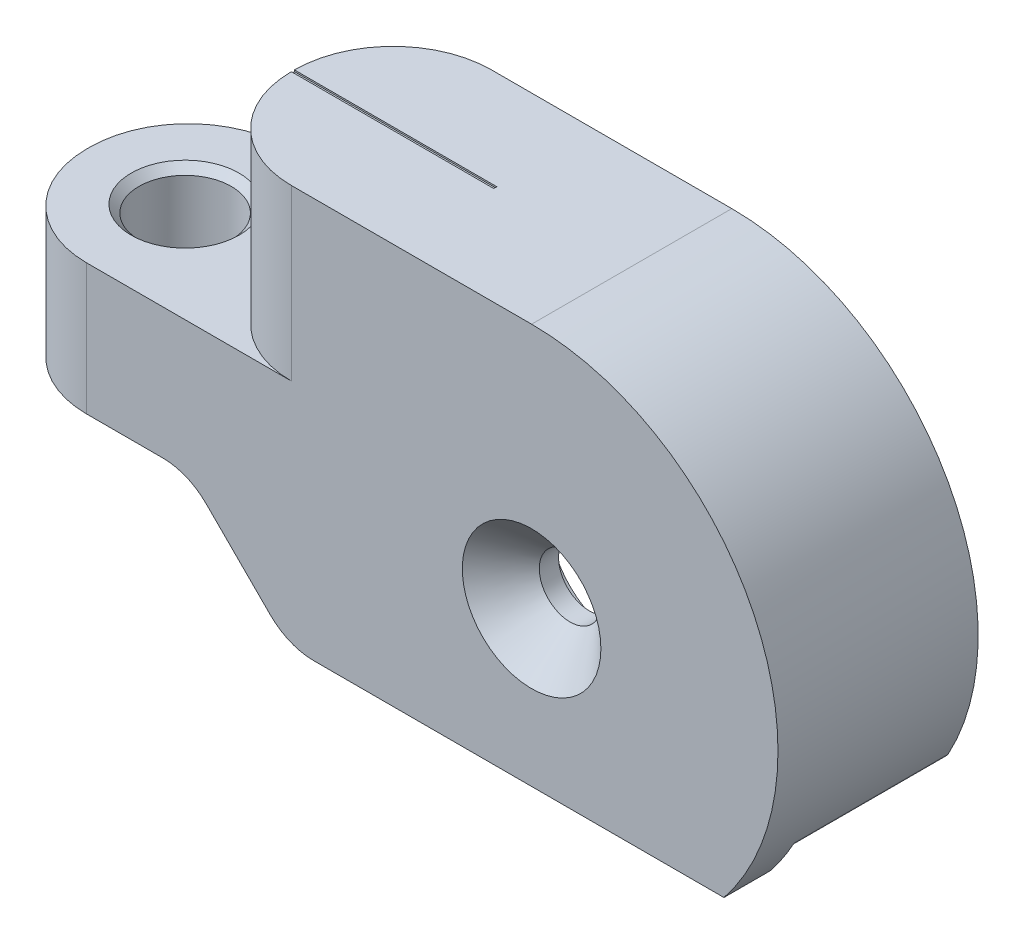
ISO-10303-21;
HEADER;
FILE_DESCRIPTION(('STEP AP214'),'2;1');
FILE_NAME('part.step','',(''),(''),'','','');
FILE_SCHEMA(('AUTOMOTIVE_DESIGN { 1 0 10303 214 1 1 1 1 }'));
ENDSEC;
DATA;
#1=APPLICATION_CONTEXT('core data for automotive mechanical design processes');
#2=APPLICATION_PROTOCOL_DEFINITION('international standard','automotive_design',2000,#1);
#3=PRODUCT_CONTEXT('',#1,'mechanical');
#4=PRODUCT('Part','Part','',(#3));
#5=PRODUCT_RELATED_PRODUCT_CATEGORY('part','',(#4));
#6=PRODUCT_DEFINITION_FORMATION('','',#4);
#7=PRODUCT_DEFINITION_CONTEXT('part definition',#1,'design');
#8=PRODUCT_DEFINITION('design','',#6,#7);
#9=PRODUCT_DEFINITION_SHAPE('','',#8);
#10=(LENGTH_UNIT() NAMED_UNIT(*) SI_UNIT(.MILLI.,.METRE.));
#11=(NAMED_UNIT(*) PLANE_ANGLE_UNIT() SI_UNIT($,.RADIAN.));
#12=(NAMED_UNIT(*) SI_UNIT($,.STERADIAN.) SOLID_ANGLE_UNIT());
#13=UNCERTAINTY_MEASURE_WITH_UNIT(LENGTH_MEASURE(1.E-05),#10,'distance_accuracy_value','');
#14=(GEOMETRIC_REPRESENTATION_CONTEXT(3) GLOBAL_UNCERTAINTY_ASSIGNED_CONTEXT((#13)) GLOBAL_UNIT_ASSIGNED_CONTEXT((#10,
#11,#12)) REPRESENTATION_CONTEXT('',''));
#15=CARTESIAN_POINT('',(0.,0.,0.));
#16=DIRECTION('',(0.,0.,1.));
#17=DIRECTION('',(1.,0.,0.));
#18=AXIS2_PLACEMENT_3D('',#15,#16,#17);
#19=CARTESIAN_POINT('',(-22.,16.,13.));
#20=DIRECTION('',(1.,0.,0.));
#21=DIRECTION('',(0.,1.,0.));
#22=AXIS2_PLACEMENT_3D('',#19,#20,#21);
#23=PLANE('',#22);
#24=DIRECTION('',(0.,0.,-1.));
#25=VECTOR('',#24,1.);
#26=CARTESIAN_POINT('',(-22.,15.9,13.));
#27=LINE('',#26,#25);
#28=CARTESIAN_POINT('',(-22.,15.9,19.6));
#29=VERTEX_POINT('',#28);
#30=CARTESIAN_POINT('',(-22.,15.9,19.4));
#31=VERTEX_POINT('',#30);
#32=EDGE_CURVE('E201',#29,#31,#27,.T.);
#33=ORIENTED_EDGE('',*,*,#32,.T.);
#34=DIRECTION('',(0.,-1.,0.));
#35=VECTOR('',#34,1.);
#36=CARTESIAN_POINT('',(-22.,16.,19.4));
#37=LINE('',#36,#35);
#38=CARTESIAN_POINT('',(-22.,5.,19.4));
#39=VERTEX_POINT('',#38);
#40=EDGE_CURVE('E351',#39,#31,#37,.F.);
#41=ORIENTED_EDGE('',*,*,#40,.F.);
#42=DIRECTION('',(0.,0.,1.));
#43=VECTOR('',#42,1.);
#44=CARTESIAN_POINT('',(-22.,5.,13.));
#45=LINE('',#44,#43);
#46=CARTESIAN_POINT('',(-22.,5.,19.6));
#47=VERTEX_POINT('',#46);
#48=EDGE_CURVE('E303',#39,#47,#45,.T.);
#49=ORIENTED_EDGE('',*,*,#48,.T.);
#50=DIRECTION('',(0.,-1.,0.));
#51=VECTOR('',#50,1.);
#52=CARTESIAN_POINT('',(-22.,16.,19.6));
#53=LINE('',#52,#51);
#54=EDGE_CURVE('E354',#29,#47,#53,.T.);
#55=ORIENTED_EDGE('',*,*,#54,.F.);
#56=EDGE_LOOP('',(#33,#41,#49,#55));
#57=FACE_BOUND('',#56,.T.);
#58=ADVANCED_FACE('F18',(#57),#23,.F.);
#59=CARTESIAN_POINT('',(-15.8,-10.,13.));
#60=DIRECTION('',(0.,1.,0.));
#61=DIRECTION('',(0.,0.,-1.));
#62=AXIS2_PLACEMENT_3D('',#59,#60,#61);
#63=PLANE('',#62);
#64=DIRECTION('',(1.,0.,0.));
#65=VECTOR('',#64,1.);
#66=CARTESIAN_POINT('',(-15.8,-10.,13.));
#67=LINE('',#66,#65);
#68=CARTESIAN_POINT('',(-14.1431457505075,-10.,13.));
#69=VERTEX_POINT('',#68);
#70=CARTESIAN_POINT('',(-12.3698713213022,-10.,13.));
#71=VERTEX_POINT('',#70);
#72=EDGE_CURVE('E276',#69,#71,#67,.T.);
#73=ORIENTED_EDGE('',*,*,#72,.T.);
#74=DIRECTION('',(0.,0.,-1.));
#75=VECTOR('',#74,1.);
#76=CARTESIAN_POINT('',(-12.3698713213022,-10.,23.));
#77=LINE('',#76,#75);
#78=CARTESIAN_POINT('',(-12.3698713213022,-10.,23.));
#79=VERTEX_POINT('',#78);
#80=EDGE_CURVE('E256',#79,#71,#77,.T.);
#81=ORIENTED_EDGE('',*,*,#80,.F.);
#82=DIRECTION('',(1.,0.,0.));
#83=VECTOR('',#82,1.);
#84=CARTESIAN_POINT('',(-12.3698713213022,-10.,23.));
#85=LINE('',#84,#83);
#86=CARTESIAN_POINT('',(12.4899959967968,-10.,23.));
#87=VERTEX_POINT('',#86);
#88=EDGE_CURVE('E241',#79,#87,#85,.T.);
#89=ORIENTED_EDGE('',*,*,#88,.T.);
#90=DIRECTION('',(0.,0.,1.));
#91=VECTOR('',#90,1.);
#92=CARTESIAN_POINT('',(12.4899959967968,-10.,13.));
#93=LINE('',#92,#91);
#94=CARTESIAN_POINT('',(12.4899959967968,-10.,26.));
#95=VERTEX_POINT('',#94);
#96=EDGE_CURVE('E279',#87,#95,#93,.T.);
#97=ORIENTED_EDGE('',*,*,#96,.T.);
#98=DIRECTION('',(1.,0.,0.));
#99=VECTOR('',#98,1.);
#100=CARTESIAN_POINT('',(-15.8,-10.,26.));
#101=LINE('',#100,#99);
#102=CARTESIAN_POINT('',(-14.1431457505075,-10.,26.));
#103=VERTEX_POINT('',#102);
#104=EDGE_CURVE('E264',#103,#95,#101,.T.);
#105=ORIENTED_EDGE('',*,*,#104,.F.);
#106=DIRECTION('',(0.,0.,1.));
#107=VECTOR('',#106,1.);
#108=CARTESIAN_POINT('',(-14.1431457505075,-10.,13.));
#109=LINE('',#108,#107);
#110=EDGE_CURVE('E336',#69,#103,#109,.T.);
#111=ORIENTED_EDGE('',*,*,#110,.F.);
#112=EDGE_LOOP('',(#73,#81,#89,#97,#105,#111));
#113=FACE_BOUND('',#112,.T.);
#114=ADVANCED_FACE('F439',(#113),#63,.F.);
#115=CARTESIAN_POINT('',(0.,0.,13.));
#116=DIRECTION('',(0.,0.,1.));
#117=DIRECTION('',(-1.,0.,0.));
#118=AXIS2_PLACEMENT_3D('',#115,#116,#117);
#119=CYLINDRICAL_SURFACE('',#118,2.);
#120=CARTESIAN_POINT('',(0.,0.,23.5));
#121=DIRECTION('',(0.,0.,1.));
#122=DIRECTION('',(1.,0.,0.));
#123=AXIS2_PLACEMENT_3D('',#120,#121,#122);
#124=CIRCLE('',#123,2.);
#125=CARTESIAN_POINT('',(2.,0.,23.5));
#126=VERTEX_POINT('',#125);
#127=EDGE_CURVE('E11',#126,#126,#124,.F.);
#128=ORIENTED_EDGE('',*,*,#127,.F.);
#129=EDGE_LOOP('',(#128));
#130=FACE_BOUND('',#129,.T.);
#131=CARTESIAN_POINT('',(0.,0.,22.25));
#132=DIRECTION('',(0.,0.,1.));
#133=DIRECTION('',(1.,0.,0.));
#134=AXIS2_PLACEMENT_3D('',#131,#132,#133);
#135=CIRCLE('',#134,2.);
#136=CARTESIAN_POINT('',(2.,0.,22.25));
#137=VERTEX_POINT('',#136);
#138=EDGE_CURVE('E225',#137,#137,#135,.T.);
#139=ORIENTED_EDGE('',*,*,#138,.F.);
#140=EDGE_LOOP('',(#139));
#141=FACE_BOUND('',#140,.T.);
#142=ADVANCED_FACE('F483',(#130,#141),#119,.F.);
#143=CARTESIAN_POINT('',(0.,0.,13.));
#144=DIRECTION('',(0.,0.,-1.));
#145=DIRECTION('',(1.,0.,0.));
#146=AXIS2_PLACEMENT_3D('',#143,#144,#145);
#147=PLANE('',#146);
#148=DIRECTION('',(-1.,0.,0.));
#149=VECTOR('',#148,1.);
#150=CARTESIAN_POINT('',(0.,16.,13.));
#151=LINE('',#150,#149);
#152=CARTESIAN_POINT('',(0.,16.,13.));
#153=VERTEX_POINT('',#152);
#154=CARTESIAN_POINT('',(-15.6,16.,13.));
#155=VERTEX_POINT('',#154);
#156=EDGE_CURVE('E263',#153,#155,#151,.T.);
#157=ORIENTED_EDGE('',*,*,#156,.F.);
#158=CARTESIAN_POINT('',(0.,0.,13.));
#159=DIRECTION('',(0.,0.,1.));
#160=DIRECTION('',(1.,0.,0.));
#161=AXIS2_PLACEMENT_3D('',#158,#159,#160);
#162=CIRCLE('',#161,16.);
#163=CARTESIAN_POINT('',(14.0613741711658,-7.63398692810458,13.));
#164=VERTEX_POINT('',#163);
#165=EDGE_CURVE('E260',#164,#153,#162,.T.);
#166=ORIENTED_EDGE('',*,*,#165,.F.);
#167=CARTESIAN_POINT('',(13.4461890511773,-7.3,13.));
#168=DIRECTION('',(0.,0.,1.));
#169=DIRECTION('',(1.,0.,0.));
#170=AXIS2_PLACEMENT_3D('',#167,#168,#169);
#171=CIRCLE('',#170,0.7);
#172=CARTESIAN_POINT('',(13.4461890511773,-8.,13.));
#173=VERTEX_POINT('',#172);
#174=EDGE_CURVE('E320',#173,#164,#171,.T.);
#175=ORIENTED_EDGE('',*,*,#174,.F.);
#176=DIRECTION('',(-1.,0.,0.));
#177=VECTOR('',#176,1.);
#178=CARTESIAN_POINT('',(9.20101607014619,-8.,13.));
#179=LINE('',#178,#177);
#180=CARTESIAN_POINT('',(13.0698713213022,-8.,13.));
#181=VERTEX_POINT('',#180);
#182=EDGE_CURVE('E212',#173,#181,#179,.T.);
#183=ORIENTED_EDGE('',*,*,#182,.T.);
#184=CARTESIAN_POINT('',(13.0698713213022,-7.3,13.));
#185=DIRECTION('',(0.,0.,1.));
#186=DIRECTION('',(1.,0.,0.));
#187=AXIS2_PLACEMENT_3D('',#184,#185,#186);
#188=CIRCLE('',#187,0.7);
#189=CARTESIAN_POINT('',(12.3698713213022,-7.3,13.));
#190=VERTEX_POINT('',#189);
#191=EDGE_CURVE('E317',#190,#181,#188,.T.);
#192=ORIENTED_EDGE('',*,*,#191,.F.);
#193=DIRECTION('',(0.,1.,0.));
#194=VECTOR('',#193,1.);
#195=CARTESIAN_POINT('',(12.3698713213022,0.,13.));
#196=LINE('',#195,#194);
#197=CARTESIAN_POINT('',(12.3698713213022,0.,13.));
#198=VERTEX_POINT('',#197);
#199=EDGE_CURVE('E239',#190,#198,#196,.T.);
#200=ORIENTED_EDGE('',*,*,#199,.T.);
#201=CARTESIAN_POINT('',(0.,0.,13.));
#202=DIRECTION('',(0.,0.,1.));
#203=DIRECTION('',(1.,0.,0.));
#204=AXIS2_PLACEMENT_3D('',#201,#202,#203);
#205=CIRCLE('',#204,12.3698713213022);
#206=CARTESIAN_POINT('',(-12.3698713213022,0.,13.));
#207=VERTEX_POINT('',#206);
#208=EDGE_CURVE('E231',#198,#207,#205,.T.);
#209=ORIENTED_EDGE('',*,*,#208,.T.);
#210=DIRECTION('',(0.,-1.,0.));
#211=VECTOR('',#210,1.);
#212=CARTESIAN_POINT('',(-12.3698713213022,0.,13.));
#213=LINE('',#212,#211);
#214=EDGE_CURVE('E249',#207,#71,#213,.T.);
#215=ORIENTED_EDGE('',*,*,#214,.T.);
#216=ORIENTED_EDGE('',*,*,#72,.F.);
#217=CARTESIAN_POINT('',(-14.1431457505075,-6.,13.));
#218=DIRECTION('',(0.,0.,1.));
#219=DIRECTION('',(1.,0.,0.));
#220=AXIS2_PLACEMENT_3D('',#217,#218,#219);
#221=CIRCLE('',#220,4.);
#222=CARTESIAN_POINT('',(-16.9715728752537,-8.82842712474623,13.));
#223=VERTEX_POINT('',#222);
#224=EDGE_CURVE('E342',#223,#69,#221,.T.);
#225=ORIENTED_EDGE('',*,*,#224,.F.);
#226=DIRECTION('',(0.707106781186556,-0.707106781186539,0.));
#227=VECTOR('',#226,1.);
#228=CARTESIAN_POINT('',(-22.3,-3.5,13.));
#229=LINE('',#228,#227);
#230=CARTESIAN_POINT('',(-21.1284271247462,-4.67157287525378,13.));
#231=VERTEX_POINT('',#230);
#232=EDGE_CURVE('E273',#231,#223,#229,.T.);
#233=ORIENTED_EDGE('',*,*,#232,.F.);
#234=CARTESIAN_POINT('',(-23.9568542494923,-7.5,13.));
#235=DIRECTION('',(0.,0.,1.));
#236=DIRECTION('',(1.,0.,0.));
#237=AXIS2_PLACEMENT_3D('',#234,#235,#236);
#238=CIRCLE('',#237,4.);
#239=CARTESIAN_POINT('',(-23.9568542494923,-3.5,13.));
#240=VERTEX_POINT('',#239);
#241=EDGE_CURVE('E347',#240,#231,#238,.F.);
#242=ORIENTED_EDGE('',*,*,#241,.F.);
#243=DIRECTION('',(1.,0.,0.));
#244=VECTOR('',#243,1.);
#245=CARTESIAN_POINT('',(-35.3,-3.5,13.));
#246=LINE('',#245,#244);
#247=CARTESIAN_POINT('',(-28.9,-3.5,13.));
#248=VERTEX_POINT('',#247);
#249=EDGE_CURVE('E270',#248,#240,#246,.T.);
#250=ORIENTED_EDGE('',*,*,#249,.F.);
#251=DIRECTION('',(0.,-1.,0.));
#252=VECTOR('',#251,1.);
#253=CARTESIAN_POINT('',(-28.9,-3.5,13.));
#254=LINE('',#253,#252);
#255=CARTESIAN_POINT('',(-28.9,5.,13.));
#256=VERTEX_POINT('',#255);
#257=EDGE_CURVE('E368',#256,#248,#254,.T.);
#258=ORIENTED_EDGE('',*,*,#257,.F.);
#259=DIRECTION('',(-1.,0.,0.));
#260=VECTOR('',#259,1.);
#261=CARTESIAN_POINT('',(-22.,5.,13.));
#262=LINE('',#261,#260);
#263=CARTESIAN_POINT('',(-15.6,5.,13.));
#264=VERTEX_POINT('',#263);
#265=EDGE_CURVE('E267',#264,#256,#262,.T.);
#266=ORIENTED_EDGE('',*,*,#265,.F.);
#267=DIRECTION('',(0.,-1.,0.));
#268=VECTOR('',#267,1.);
#269=CARTESIAN_POINT('',(-15.6,5.,13.));
#270=LINE('',#269,#268);
#271=EDGE_CURVE('E371',#155,#264,#270,.T.);
#272=ORIENTED_EDGE('',*,*,#271,.F.);
#273=EDGE_LOOP('',(#157,#166,#175,#183,#192,#200,#209,#215,#216,#225,#233,#242,#250,#258,#266,#272));
#274=FACE_BOUND('',#273,.T.);
#275=ADVANCED_FACE('F408',(#274),#147,.T.);
#276=CARTESIAN_POINT('',(0.,0.,26.));
#277=DIRECTION('',(0.,0.,-1.));
#278=DIRECTION('',(1.,0.,0.));
#279=AXIS2_PLACEMENT_3D('',#276,#277,#278);
#280=PLANE('',#279);
#281=CARTESIAN_POINT('',(0.,0.,26.));
#282=DIRECTION('',(0.,0.,1.));
#283=DIRECTION('',(1.,0.,0.));
#284=AXIS2_PLACEMENT_3D('',#281,#282,#283);
#285=CIRCLE('',#284,4.5);
#286=CARTESIAN_POINT('',(4.5,0.,26.));
#287=VERTEX_POINT('',#286);
#288=EDGE_CURVE('E26',#287,#287,#285,.T.);
#289=ORIENTED_EDGE('',*,*,#288,.F.);
#290=EDGE_LOOP('',(#289));
#291=FACE_BOUND('',#290,.T.);
#292=DIRECTION('',(-1.,0.,0.));
#293=VECTOR('',#292,1.);
#294=CARTESIAN_POINT('',(-22.,5.,26.));
#295=LINE('',#294,#293);
#296=CARTESIAN_POINT('',(-15.6,5.,26.));
#297=VERTEX_POINT('',#296);
#298=CARTESIAN_POINT('',(-28.9,5.,26.));
#299=VERTEX_POINT('',#298);
#300=EDGE_CURVE('E285',#297,#299,#295,.T.);
#301=ORIENTED_EDGE('',*,*,#300,.T.);
#302=DIRECTION('',(0.,-1.,0.));
#303=VECTOR('',#302,1.);
#304=CARTESIAN_POINT('',(-28.9,0.,26.));
#305=LINE('',#304,#303);
#306=CARTESIAN_POINT('',(-28.9,-3.5,26.));
#307=VERTEX_POINT('',#306);
#308=EDGE_CURVE('E357',#307,#299,#305,.F.);
#309=ORIENTED_EDGE('',*,*,#308,.F.);
#310=DIRECTION('',(1.,0.,0.));
#311=VECTOR('',#310,1.);
#312=CARTESIAN_POINT('',(-35.3,-3.5,26.));
#313=LINE('',#312,#311);
#314=CARTESIAN_POINT('',(-23.9568542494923,-3.5,26.));
#315=VERTEX_POINT('',#314);
#316=EDGE_CURVE('E288',#307,#315,#313,.T.);
#317=ORIENTED_EDGE('',*,*,#316,.T.);
#318=CARTESIAN_POINT('',(-23.9568542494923,-7.5,26.));
#319=DIRECTION('',(0.,0.,1.));
#320=DIRECTION('',(1.,0.,0.));
#321=AXIS2_PLACEMENT_3D('',#318,#319,#320);
#322=CIRCLE('',#321,4.);
#323=CARTESIAN_POINT('',(-21.1284271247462,-4.67157287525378,26.));
#324=VERTEX_POINT('',#323);
#325=EDGE_CURVE('E344',#324,#315,#322,.T.);
#326=ORIENTED_EDGE('',*,*,#325,.F.);
#327=DIRECTION('',(0.707106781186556,-0.707106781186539,0.));
#328=VECTOR('',#327,1.);
#329=CARTESIAN_POINT('',(-22.3,-3.5,26.));
#330=LINE('',#329,#328);
#331=CARTESIAN_POINT('',(-16.9715728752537,-8.82842712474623,26.));
#332=VERTEX_POINT('',#331);
#333=EDGE_CURVE('E291',#324,#332,#330,.T.);
#334=ORIENTED_EDGE('',*,*,#333,.T.);
#335=CARTESIAN_POINT('',(-14.1431457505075,-6.,26.));
#336=DIRECTION('',(0.,0.,1.));
#337=DIRECTION('',(1.,0.,0.));
#338=AXIS2_PLACEMENT_3D('',#335,#336,#337);
#339=CIRCLE('',#338,4.);
#340=EDGE_CURVE('E339',#103,#332,#339,.F.);
#341=ORIENTED_EDGE('',*,*,#340,.F.);
#342=ORIENTED_EDGE('',*,*,#104,.T.);
#343=CARTESIAN_POINT('',(0.,0.,26.));
#344=DIRECTION('',(0.,0.,1.));
#345=DIRECTION('',(1.,0.,0.));
#346=AXIS2_PLACEMENT_3D('',#343,#344,#345);
#347=CIRCLE('',#346,16.);
#348=CARTESIAN_POINT('',(0.,16.,26.));
#349=VERTEX_POINT('',#348);
#350=EDGE_CURVE('E255',#95,#349,#347,.T.);
#351=ORIENTED_EDGE('',*,*,#350,.T.);
#352=DIRECTION('',(-1.,0.,0.));
#353=VECTOR('',#352,1.);
#354=CARTESIAN_POINT('',(0.,16.,26.));
#355=LINE('',#354,#353);
#356=CARTESIAN_POINT('',(-15.6,16.,26.));
#357=VERTEX_POINT('',#356);
#358=EDGE_CURVE('E282',#349,#357,#355,.T.);
#359=ORIENTED_EDGE('',*,*,#358,.T.);
#360=DIRECTION('',(0.,-1.,0.));
#361=VECTOR('',#360,1.);
#362=CARTESIAN_POINT('',(-15.6,0.,26.));
#363=LINE('',#362,#361);
#364=EDGE_CURVE('E360',#297,#357,#363,.F.);
#365=ORIENTED_EDGE('',*,*,#364,.F.);
#366=EDGE_LOOP('',(#301,#309,#317,#326,#334,#341,#342,#351,#359,#365));
#367=FACE_BOUND('',#366,.T.);
#368=ADVANCED_FACE('F404',(#291,#367),#280,.F.);
#369=CARTESIAN_POINT('',(0.,0.,13.));
#370=DIRECTION('',(0.,0.,1.));
#371=DIRECTION('',(-1.,0.,0.));
#372=AXIS2_PLACEMENT_3D('',#369,#370,#371);
#373=CYLINDRICAL_SURFACE('',#372,16.);
#374=ORIENTED_EDGE('',*,*,#165,.T.);
#375=DIRECTION('',(0.,0.,1.));
#376=VECTOR('',#375,1.);
#377=CARTESIAN_POINT('',(0.,16.,13.));
#378=LINE('',#377,#376);
#379=EDGE_CURVE('E306',#153,#349,#378,.T.);
#380=ORIENTED_EDGE('',*,*,#379,.T.);
#381=ORIENTED_EDGE('',*,*,#350,.F.);
#382=ORIENTED_EDGE('',*,*,#96,.F.);
#383=CARTESIAN_POINT('',(0.,0.,23.));
#384=DIRECTION('',(0.,0.,1.));
#385=DIRECTION('',(1.,0.,0.));
#386=AXIS2_PLACEMENT_3D('',#383,#384,#385);
#387=CIRCLE('',#386,16.);
#388=CARTESIAN_POINT('',(14.0613741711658,-7.63398692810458,23.));
#389=VERTEX_POINT('',#388);
#390=EDGE_CURVE('E216',#87,#389,#387,.T.);
#391=ORIENTED_EDGE('',*,*,#390,.T.);
#392=DIRECTION('',(0.,0.,1.));
#393=VECTOR('',#392,1.);
#394=CARTESIAN_POINT('',(14.0613741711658,-7.63398692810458,13.));
#395=LINE('',#394,#393);
#396=EDGE_CURVE('E308',#164,#389,#395,.T.);
#397=ORIENTED_EDGE('',*,*,#396,.F.);
#398=EDGE_LOOP('',(#374,#380,#381,#382,#391,#397));
#399=FACE_BOUND('',#398,.T.);
#400=ADVANCED_FACE('F407',(#399),#373,.T.);
#401=CARTESIAN_POINT('',(0.,16.,13.));
#402=DIRECTION('',(0.,-1.,0.));
#403=DIRECTION('',(1.,0.,0.));
#404=AXIS2_PLACEMENT_3D('',#401,#402,#403);
#405=PLANE('',#404);
#406=DIRECTION('',(0.,0.,1.));
#407=VECTOR('',#406,1.);
#408=CARTESIAN_POINT('',(-8.85759189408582,16.,19.6));
#409=LINE('',#408,#407);
#410=CARTESIAN_POINT('',(-8.85759189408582,16.,19.4));
#411=VERTEX_POINT('',#410);
#412=CARTESIAN_POINT('',(-8.85759189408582,16.,19.6));
#413=VERTEX_POINT('',#412);
#414=EDGE_CURVE('E205',#411,#413,#409,.T.);
#415=ORIENTED_EDGE('',*,*,#414,.T.);
#416=DIRECTION('',(-1.,0.,0.));
#417=VECTOR('',#416,1.);
#418=CARTESIAN_POINT('',(-23.9290935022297,16.,19.6));
#419=LINE('',#418,#417);
#420=CARTESIAN_POINT('',(-22.,16.,19.6));
#421=VERTEX_POINT('',#420);
#422=EDGE_CURVE('E189',#413,#421,#419,.T.);
#423=ORIENTED_EDGE('',*,*,#422,.T.);
#424=CARTESIAN_POINT('',(-15.6,16.,19.6));
#425=DIRECTION('',(0.,1.,0.));
#426=DIRECTION('',(1.,0.,0.));
#427=AXIS2_PLACEMENT_3D('',#424,#425,#426);
#428=CIRCLE('',#427,6.4);
#429=EDGE_CURVE('E365',#357,#421,#428,.F.);
#430=ORIENTED_EDGE('',*,*,#429,.F.);
#431=ORIENTED_EDGE('',*,*,#358,.F.);
#432=ORIENTED_EDGE('',*,*,#379,.F.);
#433=ORIENTED_EDGE('',*,*,#156,.T.);
#434=CARTESIAN_POINT('',(-15.6,16.,19.4));
#435=DIRECTION('',(0.,1.,0.));
#436=DIRECTION('',(1.,0.,0.));
#437=AXIS2_PLACEMENT_3D('',#434,#435,#436);
#438=CIRCLE('',#437,6.4);
#439=CARTESIAN_POINT('',(-22.,16.,19.4));
#440=VERTEX_POINT('',#439);
#441=EDGE_CURVE('E363',#440,#155,#438,.F.);
#442=ORIENTED_EDGE('',*,*,#441,.F.);
#443=DIRECTION('',(1.,0.,0.));
#444=VECTOR('',#443,1.);
#445=CARTESIAN_POINT('',(-23.9290935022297,16.,19.4));
#446=LINE('',#445,#444);
#447=EDGE_CURVE('E197',#440,#411,#446,.T.);
#448=ORIENTED_EDGE('',*,*,#447,.T.);
#449=EDGE_LOOP('',(#415,#423,#430,#431,#432,#433,#442,#448));
#450=FACE_BOUND('',#449,.T.);
#451=ADVANCED_FACE('F447',(#450),#405,.F.);
#452=CARTESIAN_POINT('',(-22.,5.,13.));
#453=DIRECTION('',(0.,-1.,0.));
#454=DIRECTION('',(1.,0.,0.));
#455=AXIS2_PLACEMENT_3D('',#452,#453,#454);
#456=PLANE('',#455);
#457=CARTESIAN_POINT('',(-29.,5.,19.5));
#458=DIRECTION('',(0.,1.,0.));
#459=DIRECTION('',(1.,0.,0.));
#460=AXIS2_PLACEMENT_3D('',#457,#458,#459);
#461=CIRCLE('',#460,3.5);
#462=CARTESIAN_POINT('',(-25.5,5.,19.5));
#463=VERTEX_POINT('',#462);
#464=EDGE_CURVE('E398',#463,#463,#461,.T.);
#465=ORIENTED_EDGE('',*,*,#464,.F.);
#466=EDGE_LOOP('',(#465));
#467=FACE_BOUND('',#466,.T.);
#468=ORIENTED_EDGE('',*,*,#300,.F.);
#469=CARTESIAN_POINT('',(-15.6,5.,19.6));
#470=DIRECTION('',(0.,1.,0.));
#471=DIRECTION('',(1.,0.,0.));
#472=AXIS2_PLACEMENT_3D('',#469,#470,#471);
#473=CIRCLE('',#472,6.4);
#474=EDGE_CURVE('E385',#47,#297,#473,.T.);
#475=ORIENTED_EDGE('',*,*,#474,.F.);
#476=ORIENTED_EDGE('',*,*,#48,.F.);
#477=CARTESIAN_POINT('',(-15.6,5.,19.4));
#478=DIRECTION('',(0.,1.,0.));
#479=DIRECTION('',(1.,0.,0.));
#480=AXIS2_PLACEMENT_3D('',#477,#478,#479);
#481=CIRCLE('',#480,6.4);
#482=EDGE_CURVE('E387',#264,#39,#481,.T.);
#483=ORIENTED_EDGE('',*,*,#482,.F.);
#484=ORIENTED_EDGE('',*,*,#265,.T.);
#485=CARTESIAN_POINT('',(-28.9,5.,19.4));
#486=DIRECTION('',(0.,1.,0.));
#487=DIRECTION('',(1.,0.,0.));
#488=AXIS2_PLACEMENT_3D('',#485,#486,#487);
#489=CIRCLE('',#488,6.4);
#490=CARTESIAN_POINT('',(-35.3,5.,19.4));
#491=VERTEX_POINT('',#490);
#492=EDGE_CURVE('E381',#491,#256,#489,.F.);
#493=ORIENTED_EDGE('',*,*,#492,.F.);
#494=DIRECTION('',(0.,0.,1.));
#495=VECTOR('',#494,1.);
#496=CARTESIAN_POINT('',(-35.3,5.,13.));
#497=LINE('',#496,#495);
#498=CARTESIAN_POINT('',(-35.3,5.,19.6));
#499=VERTEX_POINT('',#498);
#500=EDGE_CURVE('E300',#491,#499,#497,.T.);
#501=ORIENTED_EDGE('',*,*,#500,.T.);
#502=CARTESIAN_POINT('',(-28.9,5.,19.6));
#503=DIRECTION('',(0.,1.,0.));
#504=DIRECTION('',(1.,0.,0.));
#505=AXIS2_PLACEMENT_3D('',#502,#503,#504);
#506=CIRCLE('',#505,6.4);
#507=EDGE_CURVE('E383',#299,#499,#506,.F.);
#508=ORIENTED_EDGE('',*,*,#507,.F.);
#509=EDGE_LOOP('',(#468,#475,#476,#483,#484,#493,#501,#508));
#510=FACE_BOUND('',#509,.T.);
#511=ADVANCED_FACE('F414',(#467,#510),#456,.F.);
#512=CARTESIAN_POINT('',(-35.3,5.,13.));
#513=DIRECTION('',(1.,0.,0.));
#514=DIRECTION('',(0.,0.,1.));
#515=AXIS2_PLACEMENT_3D('',#512,#513,#514);
#516=PLANE('',#515);
#517=ORIENTED_EDGE('',*,*,#500,.F.);
#518=DIRECTION('',(0.,-1.,0.));
#519=VECTOR('',#518,1.);
#520=CARTESIAN_POINT('',(-35.3,5.,19.4));
#521=LINE('',#520,#519);
#522=CARTESIAN_POINT('',(-35.3,-3.5,19.4));
#523=VERTEX_POINT('',#522);
#524=EDGE_CURVE('E374',#523,#491,#521,.F.);
#525=ORIENTED_EDGE('',*,*,#524,.F.);
#526=DIRECTION('',(0.,0.,1.));
#527=VECTOR('',#526,1.);
#528=CARTESIAN_POINT('',(-35.3,-3.5,13.));
#529=LINE('',#528,#527);
#530=CARTESIAN_POINT('',(-35.3,-3.5,19.6));
#531=VERTEX_POINT('',#530);
#532=EDGE_CURVE('E298',#523,#531,#529,.T.);
#533=ORIENTED_EDGE('',*,*,#532,.T.);
#534=DIRECTION('',(0.,-1.,0.));
#535=VECTOR('',#534,1.);
#536=CARTESIAN_POINT('',(-35.3,5.,19.6));
#537=LINE('',#536,#535);
#538=EDGE_CURVE('E41',#499,#531,#537,.T.);
#539=ORIENTED_EDGE('',*,*,#538,.F.);
#540=EDGE_LOOP('',(#517,#525,#533,#539));
#541=FACE_BOUND('',#540,.T.);
#542=ADVANCED_FACE('F464',(#541),#516,.F.);
#543=CARTESIAN_POINT('',(-35.3,-3.5,13.));
#544=DIRECTION('',(0.,1.,0.));
#545=DIRECTION('',(-1.,0.,0.));
#546=AXIS2_PLACEMENT_3D('',#543,#544,#545);
#547=PLANE('',#546);
#548=CARTESIAN_POINT('',(-29.,-3.5,19.5));
#549=DIRECTION('',(0.,-1.,0.));
#550=DIRECTION('',(-1.,0.,0.));
#551=AXIS2_PLACEMENT_3D('',#548,#549,#550);
#552=CIRCLE('',#551,3.5);
#553=CARTESIAN_POINT('',(-32.5,-3.5,19.5));
#554=VERTEX_POINT('',#553);
#555=EDGE_CURVE('E389',#554,#554,#552,.T.);
#556=ORIENTED_EDGE('',*,*,#555,.F.);
#557=EDGE_LOOP('',(#556));
#558=FACE_BOUND('',#557,.T.);
#559=ORIENTED_EDGE('',*,*,#532,.F.);
#560=CARTESIAN_POINT('',(-28.9,-3.5,19.4));
#561=DIRECTION('',(0.,-1.,0.));
#562=DIRECTION('',(-1.,0.,0.));
#563=AXIS2_PLACEMENT_3D('',#560,#561,#562);
#564=CIRCLE('',#563,6.4);
#565=EDGE_CURVE('E377',#248,#523,#564,.F.);
#566=ORIENTED_EDGE('',*,*,#565,.F.);
#567=ORIENTED_EDGE('',*,*,#249,.T.);
#568=DIRECTION('',(0.,0.,1.));
#569=VECTOR('',#568,1.);
#570=CARTESIAN_POINT('',(-23.9568542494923,-3.5,13.));
#571=LINE('',#570,#569);
#572=EDGE_CURVE('E334',#315,#240,#571,.F.);
#573=ORIENTED_EDGE('',*,*,#572,.F.);
#574=ORIENTED_EDGE('',*,*,#316,.F.);
#575=CARTESIAN_POINT('',(-28.9,-3.5,19.6));
#576=DIRECTION('',(0.,-1.,0.));
#577=DIRECTION('',(-1.,0.,0.));
#578=AXIS2_PLACEMENT_3D('',#575,#576,#577);
#579=CIRCLE('',#578,6.4);
#580=EDGE_CURVE('E379',#531,#307,#579,.F.);
#581=ORIENTED_EDGE('',*,*,#580,.F.);
#582=EDGE_LOOP('',(#559,#566,#567,#573,#574,#581));
#583=FACE_BOUND('',#582,.T.);
#584=ADVANCED_FACE('F423',(#558,#583),#547,.F.);
#585=CARTESIAN_POINT('',(-22.3,-3.5,13.));
#586=DIRECTION('',(0.707106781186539,0.707106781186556,0.));
#587=DIRECTION('',(-0.707106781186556,0.707106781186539,0.));
#588=AXIS2_PLACEMENT_3D('',#585,#586,#587);
#589=PLANE('',#588);
#590=ORIENTED_EDGE('',*,*,#232,.T.);
#591=DIRECTION('',(0.,0.,1.));
#592=VECTOR('',#591,1.);
#593=CARTESIAN_POINT('',(-16.9715728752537,-8.82842712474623,13.));
#594=LINE('',#593,#592);
#595=EDGE_CURVE('E330',#332,#223,#594,.F.);
#596=ORIENTED_EDGE('',*,*,#595,.F.);
#597=ORIENTED_EDGE('',*,*,#333,.F.);
#598=DIRECTION('',(0.,0.,1.));
#599=VECTOR('',#598,1.);
#600=CARTESIAN_POINT('',(-21.1284271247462,-4.67157287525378,26.));
#601=LINE('',#600,#599);
#602=EDGE_CURVE('E332',#231,#324,#601,.T.);
#603=ORIENTED_EDGE('',*,*,#602,.F.);
#604=EDGE_LOOP('',(#590,#596,#597,#603));
#605=FACE_BOUND('',#604,.T.);
#606=ADVANCED_FACE('F431',(#605),#589,.F.);
#607=CARTESIAN_POINT('',(0.,0.,23.));
#608=DIRECTION('',(0.,0.,-1.));
#609=DIRECTION('',(1.,0.,0.));
#610=AXIS2_PLACEMENT_3D('',#607,#608,#609);
#611=CYLINDRICAL_SURFACE('',#610,12.3698713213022);
#612=ORIENTED_EDGE('',*,*,#208,.F.);
#613=DIRECTION('',(0.,0.,-1.));
#614=VECTOR('',#613,1.);
#615=CARTESIAN_POINT('',(12.3698713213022,0.,23.));
#616=LINE('',#615,#614);
#617=CARTESIAN_POINT('',(12.3698713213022,0.,23.));
#618=VERTEX_POINT('',#617);
#619=EDGE_CURVE('E253',#618,#198,#616,.T.);
#620=ORIENTED_EDGE('',*,*,#619,.F.);
#621=CARTESIAN_POINT('',(0.,0.,23.));
#622=DIRECTION('',(0.,0.,1.));
#623=DIRECTION('',(1.,0.,0.));
#624=AXIS2_PLACEMENT_3D('',#621,#622,#623);
#625=CIRCLE('',#624,12.3698713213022);
#626=CARTESIAN_POINT('',(-12.3698713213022,0.,23.));
#627=VERTEX_POINT('',#626);
#628=EDGE_CURVE('E235',#618,#627,#625,.T.);
#629=ORIENTED_EDGE('',*,*,#628,.T.);
#630=DIRECTION('',(0.,0.,-1.));
#631=VECTOR('',#630,1.);
#632=CARTESIAN_POINT('',(-12.3698713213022,0.,23.));
#633=LINE('',#632,#631);
#634=EDGE_CURVE('E246',#627,#207,#633,.T.);
#635=ORIENTED_EDGE('',*,*,#634,.T.);
#636=EDGE_LOOP('',(#612,#620,#629,#635));
#637=FACE_BOUND('',#636,.T.);
#638=ADVANCED_FACE('F564',(#637),#611,.F.);
#639=CARTESIAN_POINT('',(12.3698713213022,0.,23.));
#640=DIRECTION('',(1.,0.,0.));
#641=DIRECTION('',(0.,0.,1.));
#642=AXIS2_PLACEMENT_3D('',#639,#640,#641);
#643=PLANE('',#642);
#644=DIRECTION('',(0.,1.,0.));
#645=VECTOR('',#644,1.);
#646=CARTESIAN_POINT('',(12.3698713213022,0.,23.));
#647=LINE('',#646,#645);
#648=CARTESIAN_POINT('',(12.3698713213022,-7.3,23.));
#649=VERTEX_POINT('',#648);
#650=EDGE_CURVE('E244',#649,#618,#647,.T.);
#651=ORIENTED_EDGE('',*,*,#650,.T.);
#652=ORIENTED_EDGE('',*,*,#619,.T.);
#653=ORIENTED_EDGE('',*,*,#199,.F.);
#654=DIRECTION('',(0.,0.,-1.));
#655=VECTOR('',#654,1.);
#656=CARTESIAN_POINT('',(12.3698713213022,-7.3,23.));
#657=LINE('',#656,#655);
#658=EDGE_CURVE('E323',#649,#190,#657,.T.);
#659=ORIENTED_EDGE('',*,*,#658,.F.);
#660=EDGE_LOOP('',(#651,#652,#653,#659));
#661=FACE_BOUND('',#660,.T.);
#662=ADVANCED_FACE('F561',(#661),#643,.F.);
#663=CARTESIAN_POINT('',(-12.3698713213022,0.,23.));
#664=DIRECTION('',(-1.,0.,0.));
#665=DIRECTION('',(0.,0.,-1.));
#666=AXIS2_PLACEMENT_3D('',#663,#664,#665);
#667=PLANE('',#666);
#668=ORIENTED_EDGE('',*,*,#214,.F.);
#669=ORIENTED_EDGE('',*,*,#634,.F.);
#670=DIRECTION('',(0.,-1.,0.));
#671=VECTOR('',#670,1.);
#672=CARTESIAN_POINT('',(-12.3698713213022,0.,23.));
#673=LINE('',#672,#671);
#674=EDGE_CURVE('E238',#627,#79,#673,.T.);
#675=ORIENTED_EDGE('',*,*,#674,.T.);
#676=ORIENTED_EDGE('',*,*,#80,.T.);
#677=EDGE_LOOP('',(#668,#669,#675,#676));
#678=FACE_BOUND('',#677,.T.);
#679=ADVANCED_FACE('F559',(#678),#667,.F.);
#680=CARTESIAN_POINT('',(0.,0.,23.));
#681=DIRECTION('',(0.,0.,-1.));
#682=DIRECTION('',(1.,0.,0.));
#683=AXIS2_PLACEMENT_3D('',#680,#681,#682);
#684=PLANE('',#683);
#685=ORIENTED_EDGE('',*,*,#88,.F.);
#686=ORIENTED_EDGE('',*,*,#674,.F.);
#687=ORIENTED_EDGE('',*,*,#628,.F.);
#688=ORIENTED_EDGE('',*,*,#650,.F.);
#689=CARTESIAN_POINT('',(13.0698713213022,-7.3,23.));
#690=DIRECTION('',(0.,0.,1.));
#691=DIRECTION('',(1.,0.,0.));
#692=AXIS2_PLACEMENT_3D('',#689,#690,#691);
#693=CIRCLE('',#692,0.7);
#694=CARTESIAN_POINT('',(13.0698713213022,-8.,23.));
#695=VERTEX_POINT('',#694);
#696=EDGE_CURVE('E328',#695,#649,#693,.F.);
#697=ORIENTED_EDGE('',*,*,#696,.F.);
#698=DIRECTION('',(-1.,0.,0.));
#699=VECTOR('',#698,1.);
#700=CARTESIAN_POINT('',(9.20101607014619,-8.,23.));
#701=LINE('',#700,#699);
#702=CARTESIAN_POINT('',(13.4461890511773,-8.,23.));
#703=VERTEX_POINT('',#702);
#704=EDGE_CURVE('E213',#703,#695,#701,.T.);
#705=ORIENTED_EDGE('',*,*,#704,.F.);
#706=CARTESIAN_POINT('',(13.4461890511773,-7.3,23.));
#707=DIRECTION('',(0.,0.,1.));
#708=DIRECTION('',(1.,0.,0.));
#709=AXIS2_PLACEMENT_3D('',#706,#707,#708);
#710=CIRCLE('',#709,0.7);
#711=EDGE_CURVE('E325',#389,#703,#710,.F.);
#712=ORIENTED_EDGE('',*,*,#711,.F.);
#713=ORIENTED_EDGE('',*,*,#390,.F.);
#714=EDGE_LOOP('',(#685,#686,#687,#688,#697,#705,#712,#713));
#715=FACE_BOUND('',#714,.T.);
#716=CARTESIAN_POINT('',(0.,0.,23.));
#717=DIRECTION('',(0.,0.,1.));
#718=DIRECTION('',(1.,0.,0.));
#719=AXIS2_PLACEMENT_3D('',#716,#717,#718);
#720=CIRCLE('',#719,6.5);
#721=CARTESIAN_POINT('',(6.5,0.,23.));
#722=VERTEX_POINT('',#721);
#723=EDGE_CURVE('E232',#722,#722,#720,.T.);
#724=ORIENTED_EDGE('',*,*,#723,.T.);
#725=EDGE_LOOP('',(#724));
#726=FACE_BOUND('',#725,.T.);
#727=ADVANCED_FACE('F552',(#715,#726),#684,.T.);
#728=CARTESIAN_POINT('',(0.,0.,20.25));
#729=DIRECTION('',(0.,0.,-1.));
#730=DIRECTION('',(1.,0.,0.));
#731=AXIS2_PLACEMENT_3D('',#728,#729,#730);
#732=PLANE('',#731);
#733=CARTESIAN_POINT('',(0.,0.,20.25));
#734=DIRECTION('',(0.,0.,1.));
#735=DIRECTION('',(1.,0.,0.));
#736=AXIS2_PLACEMENT_3D('',#733,#734,#735);
#737=CIRCLE('',#736,4.6);
#738=CARTESIAN_POINT('',(4.6,0.,20.25));
#739=VERTEX_POINT('',#738);
#740=EDGE_CURVE('E221',#739,#739,#737,.T.);
#741=ORIENTED_EDGE('',*,*,#740,.T.);
#742=EDGE_LOOP('',(#741));
#743=FACE_BOUND('',#742,.T.);
#744=CARTESIAN_POINT('',(0.,0.,20.25));
#745=DIRECTION('',(0.,0.,1.));
#746=DIRECTION('',(1.,0.,0.));
#747=AXIS2_PLACEMENT_3D('',#744,#745,#746);
#748=CIRCLE('',#747,6.5);
#749=CARTESIAN_POINT('',(6.5,0.,20.25));
#750=VERTEX_POINT('',#749);
#751=EDGE_CURVE('E228',#750,#750,#748,.T.);
#752=ORIENTED_EDGE('',*,*,#751,.F.);
#753=EDGE_LOOP('',(#752));
#754=FACE_BOUND('',#753,.T.);
#755=ADVANCED_FACE('F549',(#743,#754),#732,.T.);
#756=CARTESIAN_POINT('',(0.,0.,20.25));
#757=DIRECTION('',(0.,0.,1.));
#758=DIRECTION('',(-1.,0.,0.));
#759=AXIS2_PLACEMENT_3D('',#756,#757,#758);
#760=CYLINDRICAL_SURFACE('',#759,6.5);
#761=ORIENTED_EDGE('',*,*,#751,.T.);
#762=EDGE_LOOP('',(#761));
#763=FACE_BOUND('',#762,.T.);
#764=ORIENTED_EDGE('',*,*,#723,.F.);
#765=EDGE_LOOP('',(#764));
#766=FACE_BOUND('',#765,.T.);
#767=ADVANCED_FACE('F547',(#763,#766),#760,.T.);
#768=CARTESIAN_POINT('',(0.,0.,22.25));
#769=DIRECTION('',(0.,0.,-1.));
#770=DIRECTION('',(1.,0.,0.));
#771=AXIS2_PLACEMENT_3D('',#768,#769,#770);
#772=CYLINDRICAL_SURFACE('',#771,4.6);
#773=CARTESIAN_POINT('',(0.,0.,22.25));
#774=DIRECTION('',(0.,0.,1.));
#775=DIRECTION('',(1.,0.,0.));
#776=AXIS2_PLACEMENT_3D('',#773,#774,#775);
#777=CIRCLE('',#776,4.6);
#778=CARTESIAN_POINT('',(4.6,0.,22.25));
#779=VERTEX_POINT('',#778);
#780=EDGE_CURVE('E222',#779,#779,#777,.T.);
#781=ORIENTED_EDGE('',*,*,#780,.T.);
#782=EDGE_LOOP('',(#781));
#783=FACE_BOUND('',#782,.T.);
#784=ORIENTED_EDGE('',*,*,#740,.F.);
#785=EDGE_LOOP('',(#784));
#786=FACE_BOUND('',#785,.T.);
#787=ADVANCED_FACE('F543',(#783,#786),#772,.F.);
#788=CARTESIAN_POINT('',(0.,0.,22.25));
#789=DIRECTION('',(0.,0.,-1.));
#790=DIRECTION('',(1.,0.,0.));
#791=AXIS2_PLACEMENT_3D('',#788,#789,#790);
#792=PLANE('',#791);
#793=ORIENTED_EDGE('',*,*,#138,.T.);
#794=EDGE_LOOP('',(#793));
#795=FACE_BOUND('',#794,.T.);
#796=ORIENTED_EDGE('',*,*,#780,.F.);
#797=EDGE_LOOP('',(#796));
#798=FACE_BOUND('',#797,.T.);
#799=ADVANCED_FACE('F539',(#795,#798),#792,.T.);
#800=CARTESIAN_POINT('',(9.20101607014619,-8.,23.));
#801=DIRECTION('',(0.,1.,0.));
#802=DIRECTION('',(0.,0.,-1.));
#803=AXIS2_PLACEMENT_3D('',#800,#801,#802);
#804=PLANE('',#803);
#805=ORIENTED_EDGE('',*,*,#704,.T.);
#806=DIRECTION('',(0.,0.,-1.));
#807=VECTOR('',#806,1.);
#808=CARTESIAN_POINT('',(13.0698713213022,-8.,23.));
#809=LINE('',#808,#807);
#810=EDGE_CURVE('E313',#181,#695,#809,.F.);
#811=ORIENTED_EDGE('',*,*,#810,.F.);
#812=ORIENTED_EDGE('',*,*,#182,.F.);
#813=DIRECTION('',(0.,0.,1.));
#814=VECTOR('',#813,1.);
#815=CARTESIAN_POINT('',(13.4461890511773,-8.,23.));
#816=LINE('',#815,#814);
#817=EDGE_CURVE('E315',#703,#173,#816,.F.);
#818=ORIENTED_EDGE('',*,*,#817,.F.);
#819=EDGE_LOOP('',(#805,#811,#812,#818));
#820=FACE_BOUND('',#819,.T.);
#821=ADVANCED_FACE('F494',(#820),#804,.F.);
#822=CARTESIAN_POINT('',(13.4461890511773,-7.3,13.));
#823=DIRECTION('',(0.,0.,1.));
#824=DIRECTION('',(-1.,0.,0.));
#825=AXIS2_PLACEMENT_3D('',#822,#823,#824);
#826=CYLINDRICAL_SURFACE('',#825,0.7);
#827=ORIENTED_EDGE('',*,*,#174,.T.);
#828=ORIENTED_EDGE('',*,*,#396,.T.);
#829=ORIENTED_EDGE('',*,*,#711,.T.);
#830=ORIENTED_EDGE('',*,*,#817,.T.);
#831=EDGE_LOOP('',(#827,#828,#829,#830));
#832=FACE_BOUND('',#831,.T.);
#833=ADVANCED_FACE('F490',(#832),#826,.T.);
#834=CARTESIAN_POINT('',(13.0698713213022,-7.3,23.));
#835=DIRECTION('',(0.,0.,-1.));
#836=DIRECTION('',(1.,0.,0.));
#837=AXIS2_PLACEMENT_3D('',#834,#835,#836);
#838=CYLINDRICAL_SURFACE('',#837,0.7);
#839=ORIENTED_EDGE('',*,*,#696,.T.);
#840=ORIENTED_EDGE('',*,*,#658,.T.);
#841=ORIENTED_EDGE('',*,*,#191,.T.);
#842=ORIENTED_EDGE('',*,*,#810,.T.);
#843=EDGE_LOOP('',(#839,#840,#841,#842));
#844=FACE_BOUND('',#843,.T.);
#845=ADVANCED_FACE('F493',(#844),#838,.T.);
#846=CARTESIAN_POINT('',(-23.9568542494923,-7.5,13.));
#847=DIRECTION('',(0.,0.,-1.));
#848=DIRECTION('',(1.,0.,0.));
#849=AXIS2_PLACEMENT_3D('',#846,#847,#848);
#850=CYLINDRICAL_SURFACE('',#849,4.);
#851=ORIENTED_EDGE('',*,*,#241,.T.);
#852=ORIENTED_EDGE('',*,*,#602,.T.);
#853=ORIENTED_EDGE('',*,*,#325,.T.);
#854=ORIENTED_EDGE('',*,*,#572,.T.);
#855=EDGE_LOOP('',(#851,#852,#853,#854));
#856=FACE_BOUND('',#855,.T.);
#857=ADVANCED_FACE('F427',(#856),#850,.F.);
#858=CARTESIAN_POINT('',(-14.1431457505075,-6.,13.));
#859=DIRECTION('',(0.,0.,1.));
#860=DIRECTION('',(-1.,0.,0.));
#861=AXIS2_PLACEMENT_3D('',#858,#859,#860);
#862=CYLINDRICAL_SURFACE('',#861,4.);
#863=ORIENTED_EDGE('',*,*,#224,.T.);
#864=ORIENTED_EDGE('',*,*,#110,.T.);
#865=ORIENTED_EDGE('',*,*,#340,.T.);
#866=ORIENTED_EDGE('',*,*,#595,.T.);
#867=EDGE_LOOP('',(#863,#864,#865,#866));
#868=FACE_BOUND('',#867,.T.);
#869=ADVANCED_FACE('F434',(#868),#862,.T.);
#870=CARTESIAN_POINT('',(-15.6,16.,19.6));
#871=DIRECTION('',(0.,-1.,0.));
#872=DIRECTION('',(1.,0.,0.));
#873=AXIS2_PLACEMENT_3D('',#870,#871,#872);
#874=CYLINDRICAL_SURFACE('',#873,6.4);
#875=ORIENTED_EDGE('',*,*,#429,.T.);
#876=EDGE_CURVE('E355',#421,#29,#53,.T.);
#877=ORIENTED_EDGE('',*,*,#876,.T.);
#878=ORIENTED_EDGE('',*,*,#54,.T.);
#879=ORIENTED_EDGE('',*,*,#474,.T.);
#880=ORIENTED_EDGE('',*,*,#364,.T.);
#881=EDGE_LOOP('',(#875,#877,#878,#879,#880));
#882=FACE_BOUND('',#881,.T.);
#883=ADVANCED_FACE('F449',(#882),#874,.T.);
#884=CARTESIAN_POINT('',(-15.6,0.,19.4));
#885=DIRECTION('',(0.,1.,0.));
#886=DIRECTION('',(-1.,0.,0.));
#887=AXIS2_PLACEMENT_3D('',#884,#885,#886);
#888=CYLINDRICAL_SURFACE('',#887,6.4);
#889=ORIENTED_EDGE('',*,*,#441,.T.);
#890=ORIENTED_EDGE('',*,*,#271,.T.);
#891=ORIENTED_EDGE('',*,*,#482,.T.);
#892=ORIENTED_EDGE('',*,*,#40,.T.);
#893=EDGE_CURVE('E350',#31,#440,#37,.F.);
#894=ORIENTED_EDGE('',*,*,#893,.T.);
#895=EDGE_LOOP('',(#889,#890,#891,#892,#894));
#896=FACE_BOUND('',#895,.T.);
#897=ADVANCED_FACE('F457',(#896),#888,.T.);
#898=CARTESIAN_POINT('',(-28.9,5.,19.6));
#899=DIRECTION('',(0.,-1.,0.));
#900=DIRECTION('',(0.,0.,1.));
#901=AXIS2_PLACEMENT_3D('',#898,#899,#900);
#902=CYLINDRICAL_SURFACE('',#901,6.4);
#903=ORIENTED_EDGE('',*,*,#507,.T.);
#904=ORIENTED_EDGE('',*,*,#538,.T.);
#905=ORIENTED_EDGE('',*,*,#580,.T.);
#906=ORIENTED_EDGE('',*,*,#308,.T.);
#907=EDGE_LOOP('',(#903,#904,#905,#906));
#908=FACE_BOUND('',#907,.T.);
#909=ADVANCED_FACE('F419',(#908),#902,.T.);
#910=CARTESIAN_POINT('',(-28.9,0.,19.4));
#911=DIRECTION('',(0.,1.,0.));
#912=DIRECTION('',(0.,0.,-1.));
#913=AXIS2_PLACEMENT_3D('',#910,#911,#912);
#914=CYLINDRICAL_SURFACE('',#913,6.4);
#915=ORIENTED_EDGE('',*,*,#492,.T.);
#916=ORIENTED_EDGE('',*,*,#257,.T.);
#917=ORIENTED_EDGE('',*,*,#565,.T.);
#918=ORIENTED_EDGE('',*,*,#524,.T.);
#919=EDGE_LOOP('',(#915,#916,#917,#918));
#920=FACE_BOUND('',#919,.T.);
#921=ADVANCED_FACE('F462',(#920),#914,.T.);
#922=CARTESIAN_POINT('',(-29.,-5.,19.5));
#923=DIRECTION('',(0.,1.,0.));
#924=DIRECTION('',(-1.,0.,0.));
#925=AXIS2_PLACEMENT_3D('',#922,#923,#924);
#926=CYLINDRICAL_SURFACE('',#925,3.);
#927=CARTESIAN_POINT('',(-29.,-3.,19.5));
#928=DIRECTION('',(0.,-1.,0.));
#929=DIRECTION('',(0.,0.,-1.));
#930=AXIS2_PLACEMENT_3D('',#927,#928,#929);
#931=CIRCLE('',#930,3.);
#932=CARTESIAN_POINT('',(-29.,-3.,16.5));
#933=VERTEX_POINT('',#932);
#934=EDGE_CURVE('E395',#933,#933,#931,.F.);
#935=ORIENTED_EDGE('',*,*,#934,.F.);
#936=EDGE_LOOP('',(#935));
#937=FACE_BOUND('',#936,.T.);
#938=CARTESIAN_POINT('',(-29.,4.5,19.5));
#939=DIRECTION('',(0.,1.,0.));
#940=DIRECTION('',(0.,0.,1.));
#941=AXIS2_PLACEMENT_3D('',#938,#939,#940);
#942=CIRCLE('',#941,3.);
#943=CARTESIAN_POINT('',(-29.,4.5,22.5));
#944=VERTEX_POINT('',#943);
#945=EDGE_CURVE('E392',#944,#944,#942,.F.);
#946=ORIENTED_EDGE('',*,*,#945,.F.);
#947=EDGE_LOOP('',(#946));
#948=FACE_BOUND('',#947,.T.);
#949=ADVANCED_FACE('F511',(#937,#948),#926,.F.);
#950=CARTESIAN_POINT('',(-29.,-3.5,19.5));
#951=DIRECTION('',(0.,-1.,0.));
#952=DIRECTION('',(0.,0.,1.));
#953=AXIS2_PLACEMENT_3D('',#950,#951,#952);
#954=CONICAL_SURFACE('',#953,3.5,0.785398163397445);
#955=ORIENTED_EDGE('',*,*,#934,.T.);
#956=EDGE_LOOP('',(#955));
#957=FACE_BOUND('',#956,.T.);
#958=ORIENTED_EDGE('',*,*,#555,.T.);
#959=EDGE_LOOP('',(#958));
#960=FACE_BOUND('',#959,.T.);
#961=ADVANCED_FACE('F512',(#957,#960),#954,.F.);
#962=CARTESIAN_POINT('',(-29.,4.5,19.5));
#963=DIRECTION('',(0.,1.,0.));
#964=DIRECTION('',(0.,0.,-1.));
#965=AXIS2_PLACEMENT_3D('',#962,#963,#964);
#966=CONICAL_SURFACE('',#965,3.,0.78539816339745);
#967=ORIENTED_EDGE('',*,*,#464,.T.);
#968=EDGE_LOOP('',(#967));
#969=FACE_BOUND('',#968,.T.);
#970=ORIENTED_EDGE('',*,*,#945,.T.);
#971=EDGE_LOOP('',(#970));
#972=FACE_BOUND('',#971,.T.);
#973=ADVANCED_FACE('F514',(#969,#972),#966,.F.);
#974=CARTESIAN_POINT('',(0.,15.9,26.));
#975=DIRECTION('',(0.,1.,0.));
#976=DIRECTION('',(-1.,0.,0.));
#977=AXIS2_PLACEMENT_3D('',#974,#975,#976);
#978=PLANE('',#977);
#979=ORIENTED_EDGE('',*,*,#32,.F.);
#980=DIRECTION('',(-1.,0.,0.));
#981=VECTOR('',#980,1.);
#982=CARTESIAN_POINT('',(-23.9290935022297,15.9,19.6));
#983=LINE('',#982,#981);
#984=CARTESIAN_POINT('',(-8.85759189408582,15.9,19.6));
#985=VERTEX_POINT('',#984);
#986=EDGE_CURVE('E186',#985,#29,#983,.T.);
#987=ORIENTED_EDGE('',*,*,#986,.F.);
#988=DIRECTION('',(0.,0.,1.));
#989=VECTOR('',#988,1.);
#990=CARTESIAN_POINT('',(-8.85759189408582,15.9,19.6));
#991=LINE('',#990,#989);
#992=CARTESIAN_POINT('',(-8.85759189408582,15.9,19.4));
#993=VERTEX_POINT('',#992);
#994=EDGE_CURVE('E195',#993,#985,#991,.T.);
#995=ORIENTED_EDGE('',*,*,#994,.F.);
#996=DIRECTION('',(1.,0.,0.));
#997=VECTOR('',#996,1.);
#998=CARTESIAN_POINT('',(-23.9290935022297,15.9,19.4));
#999=LINE('',#998,#997);
#1000=EDGE_CURVE('E33',#31,#993,#999,.T.);
#1001=ORIENTED_EDGE('',*,*,#1000,.F.);
#1002=EDGE_LOOP('',(#979,#987,#995,#1001));
#1003=FACE_BOUND('',#1002,.T.);
#1004=ADVANCED_FACE('F199',(#1003),#978,.T.);
#1005=CARTESIAN_POINT('',(-8.85759189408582,15.9,19.6));
#1006=DIRECTION('',(1.,0.,0.));
#1007=DIRECTION('',(0.,1.,0.));
#1008=AXIS2_PLACEMENT_3D('',#1005,#1006,#1007);
#1009=PLANE('',#1008);
#1010=ORIENTED_EDGE('',*,*,#414,.F.);
#1011=DIRECTION('',(0.,1.,0.));
#1012=VECTOR('',#1011,1.);
#1013=CARTESIAN_POINT('',(-8.85759189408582,15.9,19.4));
#1014=LINE('',#1013,#1012);
#1015=EDGE_CURVE('E193',#993,#411,#1014,.T.);
#1016=ORIENTED_EDGE('',*,*,#1015,.F.);
#1017=ORIENTED_EDGE('',*,*,#994,.T.);
#1018=DIRECTION('',(0.,1.,0.));
#1019=VECTOR('',#1018,1.);
#1020=CARTESIAN_POINT('',(-8.85759189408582,15.9,19.6));
#1021=LINE('',#1020,#1019);
#1022=EDGE_CURVE('E182',#985,#413,#1021,.T.);
#1023=ORIENTED_EDGE('',*,*,#1022,.T.);
#1024=EDGE_LOOP('',(#1010,#1016,#1017,#1023));
#1025=FACE_BOUND('',#1024,.T.);
#1026=ADVANCED_FACE('F196',(#1025),#1009,.F.);
#1027=CARTESIAN_POINT('',(-23.9290935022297,15.9,19.4));
#1028=DIRECTION('',(0.,0.,-1.));
#1029=DIRECTION('',(1.,0.,0.));
#1030=AXIS2_PLACEMENT_3D('',#1027,#1028,#1029);
#1031=PLANE('',#1030);
#1032=ORIENTED_EDGE('',*,*,#893,.F.);
#1033=ORIENTED_EDGE('',*,*,#1000,.T.);
#1034=ORIENTED_EDGE('',*,*,#1015,.T.);
#1035=ORIENTED_EDGE('',*,*,#447,.F.);
#1036=EDGE_LOOP('',(#1032,#1033,#1034,#1035));
#1037=FACE_BOUND('',#1036,.T.);
#1038=ADVANCED_FACE('F729',(#1037),#1031,.F.);
#1039=CARTESIAN_POINT('',(-23.9290935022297,15.9,19.6));
#1040=DIRECTION('',(0.,0.,1.));
#1041=DIRECTION('',(-1.,0.,0.));
#1042=AXIS2_PLACEMENT_3D('',#1039,#1040,#1041);
#1043=PLANE('',#1042);
#1044=ORIENTED_EDGE('',*,*,#876,.F.);
#1045=ORIENTED_EDGE('',*,*,#422,.F.);
#1046=ORIENTED_EDGE('',*,*,#1022,.F.);
#1047=ORIENTED_EDGE('',*,*,#986,.T.);
#1048=EDGE_LOOP('',(#1044,#1045,#1046,#1047));
#1049=FACE_BOUND('',#1048,.T.);
#1050=ADVANCED_FACE('F184',(#1049),#1043,.F.);
#1051=CARTESIAN_POINT('',(0.,0.,26.));
#1052=DIRECTION('',(0.,0.,1.));
#1053=DIRECTION('',(-1.,0.,0.));
#1054=AXIS2_PLACEMENT_3D('',#1051,#1052,#1053);
#1055=CONICAL_SURFACE('',#1054,4.5,0.785398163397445);
#1056=ORIENTED_EDGE('',*,*,#127,.T.);
#1057=EDGE_LOOP('',(#1056));
#1058=FACE_BOUND('',#1057,.T.);
#1059=ORIENTED_EDGE('',*,*,#288,.T.);
#1060=EDGE_LOOP('',(#1059));
#1061=FACE_BOUND('',#1060,.T.);
#1062=ADVANCED_FACE('F20',(#1058,#1061),#1055,.F.);
#1063=CLOSED_SHELL('',(#58,#114,#142,#275,#368,#400,#451,#511,#542,#584,#606,#638,#662,#679,
#727,#755,#767,#787,#799,#821,#833,#845,#857,#869,#883,#897,#909,#921,#949,#961,#973,#1004,
#1026,#1038,#1050,#1062));
#1064=MANIFOLD_SOLID_BREP('B1',#1063);
#1065=ADVANCED_BREP_SHAPE_REPRESENTATION('',(#18,#1064),#14);
#1066=SHAPE_DEFINITION_REPRESENTATION(#9,#1065);
ENDSEC;
END-ISO-10303-21;
